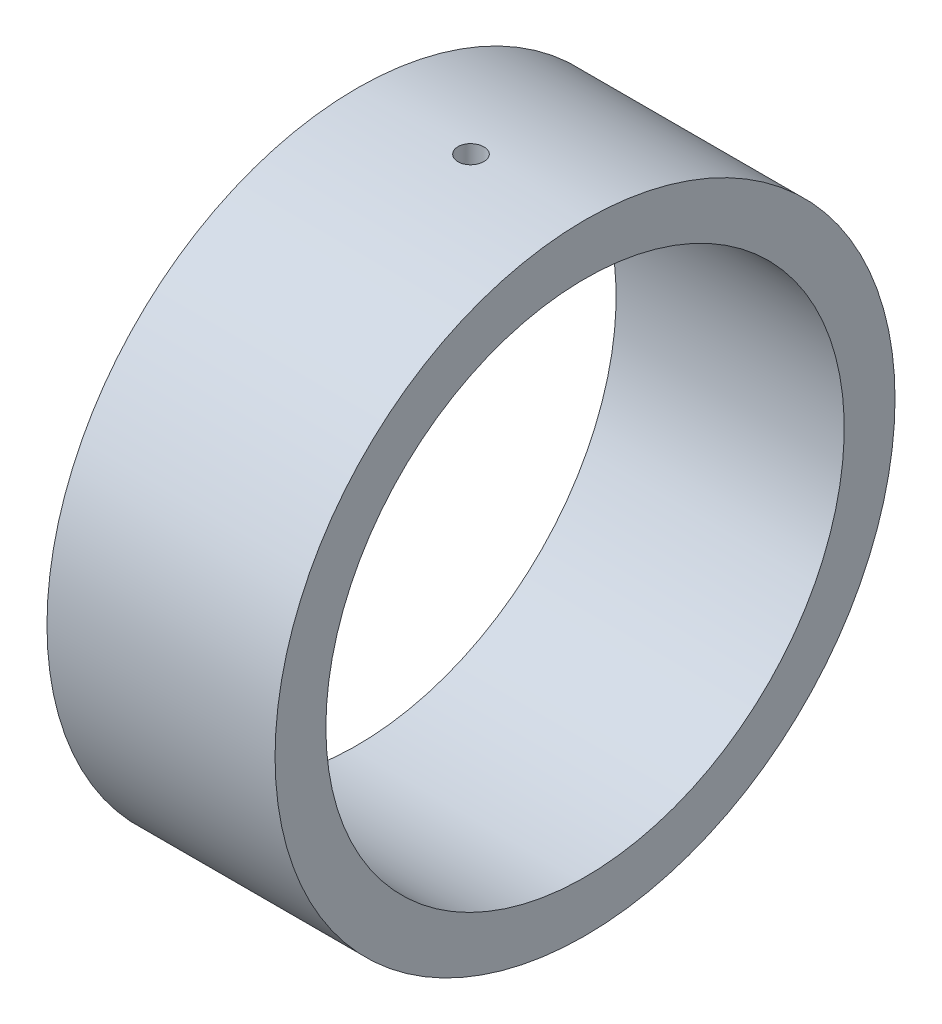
ISO-10303-21;
HEADER;
FILE_DESCRIPTION(('STEP AP214'),'2;1');
FILE_NAME('part.step','',(''),(''),'','','');
FILE_SCHEMA(('AUTOMOTIVE_DESIGN { 1 0 10303 214 1 1 1 1 }'));
ENDSEC;
DATA;
#1=APPLICATION_CONTEXT('core data for automotive mechanical design processes');
#2=APPLICATION_PROTOCOL_DEFINITION('international standard','automotive_design',2000,#1);
#3=PRODUCT_CONTEXT('',#1,'mechanical');
#4=PRODUCT('Part','Part','',(#3));
#5=PRODUCT_RELATED_PRODUCT_CATEGORY('part','',(#4));
#6=PRODUCT_DEFINITION_FORMATION('','',#4);
#7=PRODUCT_DEFINITION_CONTEXT('part definition',#1,'design');
#8=PRODUCT_DEFINITION('design','',#6,#7);
#9=PRODUCT_DEFINITION_SHAPE('','',#8);
#10=(LENGTH_UNIT() NAMED_UNIT(*) SI_UNIT(.MILLI.,.METRE.));
#11=(NAMED_UNIT(*) PLANE_ANGLE_UNIT() SI_UNIT($,.RADIAN.));
#12=(NAMED_UNIT(*) SI_UNIT($,.STERADIAN.) SOLID_ANGLE_UNIT());
#13=UNCERTAINTY_MEASURE_WITH_UNIT(LENGTH_MEASURE(1.E-05),#10,'distance_accuracy_value','');
#14=(GEOMETRIC_REPRESENTATION_CONTEXT(3) GLOBAL_UNCERTAINTY_ASSIGNED_CONTEXT((#13)) GLOBAL_UNIT_ASSIGNED_CONTEXT((#10,
#11,#12)) REPRESENTATION_CONTEXT('',''));
#15=CARTESIAN_POINT('',(0.,0.,0.));
#16=DIRECTION('',(0.,0.,1.));
#17=DIRECTION('',(1.,0.,0.));
#18=AXIS2_PLACEMENT_3D('',#15,#16,#17);
#19=CARTESIAN_POINT('',(27.,0.,0.));
#20=DIRECTION('',(-1.,0.,0.));
#21=DIRECTION('',(0.,0.,1.));
#22=AXIS2_PLACEMENT_3D('',#19,#20,#21);
#23=CYLINDRICAL_SURFACE('',#22,25.);
#24=CARTESIAN_POINT('',(27.,0.,0.));
#25=DIRECTION('',(-1.,0.,0.));
#26=DIRECTION('',(0.,0.,1.));
#27=AXIS2_PLACEMENT_3D('',#24,#25,#26);
#28=CIRCLE('',#27,25.);
#29=CARTESIAN_POINT('',(27.,0.,25.));
#30=VERTEX_POINT('',#29);
#31=EDGE_CURVE('E39',#30,#30,#28,.T.);
#32=ORIENTED_EDGE('',*,*,#31,.F.);
#33=EDGE_LOOP('',(#32));
#34=FACE_BOUND('',#33,.T.);
#35=CARTESIAN_POINT('',(5.,0.,0.));
#36=DIRECTION('',(-1.,0.,0.));
#37=DIRECTION('',(0.,0.,1.));
#38=AXIS2_PLACEMENT_3D('',#35,#36,#37);
#39=CIRCLE('',#38,25.);
#40=CARTESIAN_POINT('',(5.,0.,25.));
#41=VERTEX_POINT('',#40);
#42=EDGE_CURVE('E62',#41,#41,#39,.F.);
#43=ORIENTED_EDGE('',*,*,#42,.F.);
#44=EDGE_LOOP('',(#43));
#45=FACE_BOUND('',#44,.T.);
#46=CARTESIAN_POINT('',(14.75,25.,0.));
#47=CARTESIAN_POINT('',(14.7500029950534,24.9999995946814,0.0701708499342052));
#48=CARTESIAN_POINT('',(14.7559282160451,24.9997014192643,0.140387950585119));
#49=CARTESIAN_POINT('',(14.7794798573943,24.9985406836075,0.278881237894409));
#50=CARTESIAN_POINT('',(14.7971191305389,24.9976775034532,0.347155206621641));
#51=CARTESIAN_POINT('',(14.8435925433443,24.9954844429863,0.479741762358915));
#52=CARTESIAN_POINT('',(14.8724213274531,24.9941547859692,0.544056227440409));
#53=CARTESIAN_POINT('',(14.9404472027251,24.9911785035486,0.666916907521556));
#54=CARTESIAN_POINT('',(14.9796420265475,24.9895319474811,0.725464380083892));
#55=CARTESIAN_POINT('',(15.0673308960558,24.9861052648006,0.835203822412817));
#56=CARTESIAN_POINT('',(15.1158330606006,24.9843250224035,0.886389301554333));
#57=CARTESIAN_POINT('',(15.2207435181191,24.9808326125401,0.979896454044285));
#58=CARTESIAN_POINT('',(15.2771521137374,24.9791204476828,1.02221778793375));
#59=CARTESIAN_POINT('',(15.3963087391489,24.975956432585,1.09681356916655));
#60=CARTESIAN_POINT('',(15.4590599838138,24.9745047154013,1.12908288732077));
#61=CARTESIAN_POINT('',(15.5890979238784,24.9720267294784,1.18262570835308));
#62=CARTESIAN_POINT('',(15.6563845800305,24.9710004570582,1.20389930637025));
#63=CARTESIAN_POINT('',(15.7935231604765,24.9694901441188,1.23482956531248));
#64=CARTESIAN_POINT('',(15.8633728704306,24.9690056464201,1.24449602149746));
#65=CARTESIAN_POINT('',(16.003705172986,24.9686321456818,1.25196782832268));
#66=CARTESIAN_POINT('',(16.0741877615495,24.9687431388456,1.24977325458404));
#67=CARTESIAN_POINT('',(16.2137180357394,24.9695476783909,1.23359346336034));
#68=CARTESIAN_POINT('',(16.2827669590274,24.9702406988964,1.21961888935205));
#69=CARTESIAN_POINT('',(16.4175382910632,24.972130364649,1.18029205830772));
#70=CARTESIAN_POINT('',(16.4832606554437,24.9733270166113,1.15493964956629));
#71=CARTESIAN_POINT('',(16.6095490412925,24.9760897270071,1.09356362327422));
#72=CARTESIAN_POINT('',(16.670112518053,24.9776559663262,1.05753477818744));
#73=CARTESIAN_POINT('',(16.784330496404,24.9809809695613,0.975835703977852));
#74=CARTESIAN_POINT('',(16.8379855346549,24.9827397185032,0.930166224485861));
#75=CARTESIAN_POINT('',(16.9369216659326,24.9862536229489,0.830431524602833));
#76=CARTESIAN_POINT('',(16.982195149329,24.9880087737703,0.776358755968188));
#77=CARTESIAN_POINT('',(17.0630445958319,24.9913170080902,0.661345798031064));
#78=CARTESIAN_POINT('',(17.0986159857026,24.9928699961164,0.600402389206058));
#79=CARTESIAN_POINT('',(17.1590461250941,24.9955990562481,0.473358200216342));
#80=CARTESIAN_POINT('',(17.1838956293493,24.9967748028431,0.407253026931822));
#81=CARTESIAN_POINT('',(17.2220885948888,24.9986125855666,0.271893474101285));
#82=CARTESIAN_POINT('',(17.2354565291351,24.9992757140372,0.202646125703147));
#83=CARTESIAN_POINT('',(17.2452787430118,24.9997643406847,0.110795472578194));
#84=CARTESIAN_POINT('',(17.2470479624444,24.9998525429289,0.0886760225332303));
#85=CARTESIAN_POINT('',(17.2494090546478,24.9999704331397,0.0443742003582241));
#86=CARTESIAN_POINT('',(17.2500009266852,25.0000001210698,0.0221918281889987));
#87=CARTESIAN_POINT('',(17.2499970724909,24.9999996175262,-0.0701066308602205));
#88=CARTESIAN_POINT('',(17.2440779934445,24.9997017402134,-0.140307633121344));
#89=CARTESIAN_POINT('',(17.2205383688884,24.9985415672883,-0.278817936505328));
#90=CARTESIAN_POINT('',(17.2028928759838,24.9976780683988,-0.347122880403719));
#91=CARTESIAN_POINT('',(17.1564042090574,24.9954842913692,-0.479749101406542));
#92=CARTESIAN_POINT('',(17.1275706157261,24.9941544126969,-0.544073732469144));
#93=CARTESIAN_POINT('',(17.0595417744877,24.9911780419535,-0.666933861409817));
#94=CARTESIAN_POINT('',(17.0203516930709,24.9895317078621,-0.725472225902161));
#95=CARTESIAN_POINT('',(16.9326752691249,24.9861054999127,-0.835196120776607));
#96=CARTESIAN_POINT('',(16.8841807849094,24.9843255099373,-0.886375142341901));
#97=CARTESIAN_POINT('',(16.7792714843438,24.9808330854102,-0.979884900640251));
#98=CARTESIAN_POINT('',(16.7228541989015,24.9791206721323,-1.02221286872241));
#99=CARTESIAN_POINT('',(16.6036601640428,24.9759555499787,-1.09683400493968));
#100=CARTESIAN_POINT('',(16.5408775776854,24.9745030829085,-1.12911785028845));
#101=CARTESIAN_POINT('',(16.4108202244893,24.9720256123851,-1.18265015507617));
#102=CARTESIAN_POINT('',(16.3435505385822,24.9710001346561,-1.20391086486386));
#103=CARTESIAN_POINT('',(16.2299245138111,24.9697481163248,-1.22954319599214));
#104=CARTESIAN_POINT('',(16.1842847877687,24.9693682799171,-1.23720422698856));
#105=CARTESIAN_POINT('',(16.0924367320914,24.9688593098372,-1.24743361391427));
#106=CARTESIAN_POINT('',(16.0462284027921,24.9687301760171,-1.25000197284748));
#107=CARTESIAN_POINT('',(15.9298292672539,24.9687308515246,-1.24999700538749));
#108=CARTESIAN_POINT('',(15.8596122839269,24.9690294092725,-1.24407180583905));
#109=CARTESIAN_POINT('',(15.7211191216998,24.9701915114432,-1.22052022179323));
#110=CARTESIAN_POINT('',(15.6528451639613,24.9710556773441,-1.20288096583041));
#111=CARTESIAN_POINT('',(15.5202575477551,24.9732508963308,-1.1564072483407));
#112=CARTESIAN_POINT('',(15.455942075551,24.9745817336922,-1.12757795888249));
#113=CARTESIAN_POINT('',(15.3330817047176,24.9775599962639,-1.05955180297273));
#114=CARTESIAN_POINT('',(15.2745353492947,24.9792073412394,-1.02035756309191));
#115=CARTESIAN_POINT('',(15.1648030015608,24.982634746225,-0.932674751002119));
#116=CARTESIAN_POINT('',(15.1136228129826,24.9844149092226,-0.884178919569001));
#117=CARTESIAN_POINT('',(15.0201134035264,24.9879068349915,-0.779269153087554));
#118=CARTESIAN_POINT('',(14.9777865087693,24.9896185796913,-0.722853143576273));
#119=CARTESIAN_POINT('',(14.9031663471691,24.9927819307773,-0.603660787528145));
#120=CARTESIAN_POINT('',(14.8708825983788,24.9942332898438,-0.540878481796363));
#121=CARTESIAN_POINT('',(14.8173501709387,24.9967085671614,-0.410821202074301));
#122=CARTESIAN_POINT('',(14.796089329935,24.9977329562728,-0.343551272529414));
#123=CARTESIAN_POINT('',(14.7704568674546,24.9989835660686,-0.229924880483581));
#124=CARTESIAN_POINT('',(14.7627958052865,24.9993629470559,-0.184285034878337));
#125=CARTESIAN_POINT('',(14.752566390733,24.9998712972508,-0.0924368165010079));
#126=CARTESIAN_POINT('',(14.7499980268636,25.0000002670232,-0.0462284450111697));
#127=CARTESIAN_POINT('',(14.75,25.,0.));
#128=B_SPLINE_CURVE_WITH_KNOTS('',3,(#46,#47,#48,#49,#50,#51,#52,#53,#54,#55,#56,#57,#58,#59,
#60,#61,#62,#63,#64,#65,#66,#67,#68,#69,#70,#71,#72,#73,#74,#75,#76,#77,#78,#79,#80,#81,#82,#83,
#84,#85,#86,#87,#88,#89,#90,#91,#92,#93,#94,#95,#96,#97,#98,#99,#100,#101,#102,#103,#104,#105,
#106,#107,#108,#109,#110,#111,#112,#113,#114,#115,#116,#117,#118,#119,#120,#121,#122,#123,#124,
#125,#126,#127),.UNSPECIFIED.,.T.,.F.,(4,2,2,2,2,2,2,2,2,2,2,2,2,2,2,2,2,2,2,2,2,2,2,2,2,2,2,2,
2,2,2,2,2,2,2,2,2,2,2,2,4),(0.,0.210344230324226,0.420919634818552,0.631394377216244,
0.841823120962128,1.0524362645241,1.26305747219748,1.47378597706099,1.68451265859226,
1.89506138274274,2.10560876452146,2.31596611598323,2.52632627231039,2.73678959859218,
2.94723656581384,3.15787367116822,3.3686098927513,3.57952746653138,3.78999434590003,
3.85654306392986,3.92309182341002,4.13332728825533,4.34401145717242,4.55451560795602,
4.76491494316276,4.97549923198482,5.1861492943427,5.39699429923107,5.60760448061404,
5.7461788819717,5.88475320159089,6.09509708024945,6.30567246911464,6.51615064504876,
6.72657553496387,6.93716531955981,7.1478103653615,7.35865443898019,7.56926537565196,
7.70784013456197,7.84641458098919),.UNSPECIFIED.);
#129=CARTESIAN_POINT('',(14.75,25.,0.));
#130=VERTEX_POINT('',#129);
#131=EDGE_CURVE('E19',#130,#130,#128,.T.);
#132=ORIENTED_EDGE('',*,*,#131,.T.);
#133=EDGE_LOOP('',(#132));
#134=FACE_BOUND('',#133,.T.);
#135=ADVANCED_FACE('F14',(#34,#45,#134),#23,.F.);
#136=CARTESIAN_POINT('',(16.,0.,0.));
#137=DIRECTION('',(0.,1.,0.));
#138=DIRECTION('',(0.,0.,1.));
#139=AXIS2_PLACEMENT_3D('',#136,#137,#138);
#140=CYLINDRICAL_SURFACE('',#139,1.25);
#141=ORIENTED_EDGE('',*,*,#131,.F.);
#142=EDGE_LOOP('',(#141));
#143=FACE_BOUND('',#142,.T.);
#144=CARTESIAN_POINT('',(17.25,29.9,0.));
#145=CARTESIAN_POINT('',(17.2499970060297,29.8999996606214,0.0701853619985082));
#146=CARTESIAN_POINT('',(17.2440693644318,29.8997502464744,0.140417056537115));
#147=CARTESIAN_POINT('',(17.2205076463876,29.8987793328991,0.278939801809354));
#148=CARTESIAN_POINT('',(17.2028606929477,29.8980573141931,0.347228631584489));
#149=CARTESIAN_POINT('',(17.1563656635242,29.8962229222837,0.47984512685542));
#150=CARTESIAN_POINT('',(17.1275228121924,29.8951107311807,0.544174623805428));
#151=CARTESIAN_POINT('',(17.0594624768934,29.8926213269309,0.6670624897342));
#152=CARTESIAN_POINT('',(17.0202472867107,29.8912441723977,0.725622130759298));
#153=CARTESIAN_POINT('',(16.932522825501,29.8883787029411,0.835367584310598));
#154=CARTESIAN_POINT('',(16.8840076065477,29.8868903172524,0.886548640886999));
#155=CARTESIAN_POINT('',(16.7790718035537,29.8839707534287,0.980043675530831));
#156=CARTESIAN_POINT('',(16.7226509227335,29.8825395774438,1.0223573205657));
#157=CARTESIAN_POINT('',(16.6034819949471,29.8798953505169,1.09692828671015));
#158=CARTESIAN_POINT('',(16.5407317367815,29.8786823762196,1.1291820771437));
#159=CARTESIAN_POINT('',(16.4107009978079,29.8766121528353,1.18269502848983));
#160=CARTESIAN_POINT('',(16.3434205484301,29.8757549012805,1.2039542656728));
#161=CARTESIAN_POINT('',(16.2062812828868,29.8744934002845,1.23486263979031));
#162=CARTESIAN_POINT('',(16.136424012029,29.8740888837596,1.24451862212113));
#163=CARTESIAN_POINT('',(15.9960788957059,29.8737776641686,1.2519675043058));
#164=CARTESIAN_POINT('',(15.9255910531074,29.8738709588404,1.24976045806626));
#165=CARTESIAN_POINT('',(15.7860326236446,29.8745445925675,1.23355166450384));
#166=CARTESIAN_POINT('',(15.7169611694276,29.8751246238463,1.21955737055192));
#167=CARTESIAN_POINT('',(15.5821480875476,29.8767058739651,1.18018265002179));
#168=CARTESIAN_POINT('',(15.5164065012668,29.8777070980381,1.15480208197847));
#169=CARTESIAN_POINT('',(15.3900937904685,29.8800182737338,1.09336570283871));
#170=CARTESIAN_POINT('',(15.3295245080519,29.8813283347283,1.0573061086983));
#171=CARTESIAN_POINT('',(15.2153015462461,29.8841092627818,0.975541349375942));
#172=CARTESIAN_POINT('',(15.1616473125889,29.8855801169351,0.929836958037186));
#173=CARTESIAN_POINT('',(15.0627379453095,29.8885180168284,0.830047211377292));
#174=CARTESIAN_POINT('',(15.0174876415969,29.8899850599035,0.775957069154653));
#175=CARTESIAN_POINT('',(14.9366875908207,29.8927498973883,0.660914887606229));
#176=CARTESIAN_POINT('',(14.9011424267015,29.8940476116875,0.599959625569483));
#177=CARTESIAN_POINT('',(14.8407668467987,29.8963276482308,0.472899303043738));
#178=CARTESIAN_POINT('',(14.8159455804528,29.8973097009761,0.406789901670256));
#179=CARTESIAN_POINT('',(14.7778085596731,29.8988441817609,0.271429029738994));
#180=CARTESIAN_POINT('',(14.7644683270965,29.8993975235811,0.202184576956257));
#181=CARTESIAN_POINT('',(14.7546888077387,29.8998043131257,0.110414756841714));
#182=CARTESIAN_POINT('',(14.7529317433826,29.8998775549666,0.0883710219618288));
#183=CARTESIAN_POINT('',(14.7505868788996,29.8999754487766,0.0442213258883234));
#184=CARTESIAN_POINT('',(14.7499990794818,29.9000001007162,0.0221153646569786));
#185=CARTESIAN_POINT('',(14.7500029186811,29.8999996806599,-0.0701210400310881));
#186=CARTESIAN_POINT('',(14.7559244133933,29.8997505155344,-0.140336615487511));
#187=CARTESIAN_POINT('',(14.7794740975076,29.8987800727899,-0.278876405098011));
#188=CARTESIAN_POINT('',(14.7971272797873,29.8980577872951,-0.347196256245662));
#189=CARTESIAN_POINT('',(14.8436375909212,29.8962227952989,-0.479852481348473));
#190=CARTESIAN_POINT('',(14.8724852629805,29.8951104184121,-0.544192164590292));
#191=CARTESIAN_POINT('',(14.940548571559,29.8926209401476,-0.667079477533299));
#192=CARTESIAN_POINT('',(14.9797590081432,29.8912439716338,-0.725629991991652));
#193=CARTESIAN_POINT('',(15.0674709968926,29.888378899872,-0.835359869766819));
#194=CARTESIAN_POINT('',(15.1159785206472,29.8868907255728,-0.886534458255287));
#195=CARTESIAN_POINT('',(15.2209131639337,29.8839711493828,-0.980032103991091));
#196=CARTESIAN_POINT('',(15.2773427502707,29.8825397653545,-1.02235239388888));
#197=CARTESIAN_POINT('',(15.3965491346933,29.8798946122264,-1.0969487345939));
#198=CARTESIAN_POINT('',(15.4593307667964,29.8786810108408,-1.12921705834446));
#199=CARTESIAN_POINT('',(15.5893809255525,29.8766112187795,-1.18271948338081));
#200=CARTESIAN_POINT('',(15.6566443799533,29.8757546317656,-1.20396582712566));
#201=CARTESIAN_POINT('',(15.7702329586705,29.8747092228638,-1.22957145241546));
#202=CARTESIAN_POINT('',(15.8158421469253,29.8743921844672,-1.23722193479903));
#203=CARTESIAN_POINT('',(15.90762753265,29.8739673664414,-1.24743719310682));
#204=CARTESIAN_POINT('',(15.9538037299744,29.8738595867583,-1.25000197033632));
#205=CARTESIAN_POINT('',(16.0701852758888,29.8738601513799,-1.24999700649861));
#206=CARTESIAN_POINT('',(16.1404168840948,29.8741097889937,-1.24406938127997));
#207=CARTESIAN_POINT('',(16.2789395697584,29.8750815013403,-1.22050769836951));
#208=CARTESIAN_POINT('',(16.3472284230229,29.8758040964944,-1.20286074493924));
#209=CARTESIAN_POINT('',(16.4798460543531,29.8776397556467,-1.15636535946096));
#210=CARTESIAN_POINT('',(16.5441765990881,29.8787526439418,-1.12752196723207));
#211=CARTESIAN_POINT('',(16.667064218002,29.8812432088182,-1.05946127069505));
#212=CARTESIAN_POINT('',(16.7256227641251,29.8826208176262,-1.02024662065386));
#213=CARTESIAN_POINT('',(16.8353610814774,29.8854866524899,-0.932528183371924));
#214=CARTESIAN_POINT('',(16.8865367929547,29.8869749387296,-0.884019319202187));
#215=CARTESIAN_POINT('',(16.980033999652,29.8898942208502,-0.779084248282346));
#216=CARTESIAN_POINT('',(17.0223531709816,29.8913252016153,-0.722655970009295));
#217=CARTESIAN_POINT('',(17.0969484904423,29.8939693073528,-0.603451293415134));
#218=CARTESIAN_POINT('',(17.1292167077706,29.8951822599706,-0.540669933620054));
#219=CARTESIAN_POINT('',(17.1827192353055,29.89725077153,-0.410619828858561));
#220=CARTESIAN_POINT('',(17.2039656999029,29.8981067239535,-0.343356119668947));
#221=CARTESIAN_POINT('',(17.2295714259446,29.8991513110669,-0.229767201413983));
#222=CARTESIAN_POINT('',(17.2372219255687,29.8994680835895,-0.184157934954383));
#223=CARTESIAN_POINT('',(17.2474371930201,29.8998925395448,-0.0923724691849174));
#224=CARTESIAN_POINT('',(17.2500019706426,29.9000002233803,-0.0461962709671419));
#225=CARTESIAN_POINT('',(17.25,29.9,0.));
#226=B_SPLINE_CURVE_WITH_KNOTS('',3,(#144,#145,#146,#147,#148,#149,#150,#151,#152,#153,#154,
#155,#156,#157,#158,#159,#160,#161,#162,#163,#164,#165,#166,#167,#168,#169,#170,#171,#172,#173,
#174,#175,#176,#177,#178,#179,#180,#181,#182,#183,#184,#185,#186,#187,#188,#189,#190,#191,#192,
#193,#194,#195,#196,#197,#198,#199,#200,#201,#202,#203,#204,#205,#206,#207,#208,#209,#210,#211,
#212,#213,#214,#215,#216,#217,#218,#219,#220,#221,#222,#223,#224,#225),.UNSPECIFIED.,.T.,.F.,(4,
2,2,2,2,2,2,2,2,2,2,2,2,2,2,2,2,2,2,2,2,2,2,2,2,2,2,2,2,2,2,2,2,2,2,2,2,2,2,2,4),(0.,
0.210387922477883,0.421007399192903,0.631528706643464,0.8420034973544,1.05261335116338,
1.26323111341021,1.47392271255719,1.68461285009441,1.89517862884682,2.10574345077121,
2.316175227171,2.52660961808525,2.7371186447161,2.94761078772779,3.15822353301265,
3.36893556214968,3.57982701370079,3.79026771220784,3.85658723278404,3.92290679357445,
4.13318578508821,4.34391419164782,4.55446496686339,4.76491028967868,4.97549123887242,
5.18613790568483,5.39694610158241,5.60751964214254,5.74599780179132,5.884475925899,
6.09486359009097,6.30548314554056,6.51600800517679,6.72647903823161,6.93706536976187,
7.14770688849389,7.35851419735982,7.56908853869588,7.70756693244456,7.84604505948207),.UNSPECIFIED.);
#227=CARTESIAN_POINT('',(17.25,29.9,0.));
#228=VERTEX_POINT('',#227);
#229=EDGE_CURVE('E32',#228,#228,#226,.T.);
#230=ORIENTED_EDGE('',*,*,#229,.F.);
#231=EDGE_LOOP('',(#230));
#232=FACE_BOUND('',#231,.T.);
#233=ADVANCED_FACE('F40',(#143,#232),#140,.F.);
#234=CARTESIAN_POINT('',(5.,27.45,0.));
#235=DIRECTION('',(-1.,0.,0.));
#236=DIRECTION('',(0.,0.,1.));
#237=AXIS2_PLACEMENT_3D('',#234,#235,#236);
#238=PLANE('',#237);
#239=CARTESIAN_POINT('',(5.,0.,0.));
#240=DIRECTION('',(-1.,0.,0.));
#241=DIRECTION('',(0.,0.,1.));
#242=AXIS2_PLACEMENT_3D('',#239,#240,#241);
#243=CIRCLE('',#242,29.9);
#244=CARTESIAN_POINT('',(5.,0.,29.9));
#245=VERTEX_POINT('',#244);
#246=EDGE_CURVE('E27',#245,#245,#243,.F.);
#247=ORIENTED_EDGE('',*,*,#246,.F.);
#248=EDGE_LOOP('',(#247));
#249=FACE_BOUND('',#248,.T.);
#250=ORIENTED_EDGE('',*,*,#42,.T.);
#251=EDGE_LOOP('',(#250));
#252=FACE_BOUND('',#251,.T.);
#253=ADVANCED_FACE('F44',(#249,#252),#238,.T.);
#254=CARTESIAN_POINT('',(27.,27.45,0.));
#255=DIRECTION('',(1.,0.,0.));
#256=DIRECTION('',(0.,0.,-1.));
#257=AXIS2_PLACEMENT_3D('',#254,#255,#256);
#258=PLANE('',#257);
#259=ORIENTED_EDGE('',*,*,#31,.T.);
#260=EDGE_LOOP('',(#259));
#261=FACE_BOUND('',#260,.T.);
#262=CARTESIAN_POINT('',(27.,0.,0.));
#263=DIRECTION('',(-1.,0.,0.));
#264=DIRECTION('',(0.,0.,1.));
#265=AXIS2_PLACEMENT_3D('',#262,#263,#264);
#266=CIRCLE('',#265,29.9);
#267=CARTESIAN_POINT('',(27.,0.,29.9));
#268=VERTEX_POINT('',#267);
#269=EDGE_CURVE('E10',#268,#268,#266,.T.);
#270=ORIENTED_EDGE('',*,*,#269,.F.);
#271=EDGE_LOOP('',(#270));
#272=FACE_BOUND('',#271,.T.);
#273=ADVANCED_FACE('F49',(#261,#272),#258,.T.);
#274=CARTESIAN_POINT('',(16.,0.,0.));
#275=DIRECTION('',(-1.,0.,0.));
#276=DIRECTION('',(0.,0.,1.));
#277=AXIS2_PLACEMENT_3D('',#274,#275,#276);
#278=CYLINDRICAL_SURFACE('',#277,29.9);
#279=ORIENTED_EDGE('',*,*,#229,.T.);
#280=EDGE_LOOP('',(#279));
#281=FACE_BOUND('',#280,.T.);
#282=ORIENTED_EDGE('',*,*,#246,.T.);
#283=EDGE_LOOP('',(#282));
#284=FACE_BOUND('',#283,.T.);
#285=ORIENTED_EDGE('',*,*,#269,.T.);
#286=EDGE_LOOP('',(#285));
#287=FACE_BOUND('',#286,.T.);
#288=ADVANCED_FACE('F16',(#281,#284,#287),#278,.T.);
#289=CLOSED_SHELL('',(#135,#233,#253,#273,#288));
#290=MANIFOLD_SOLID_BREP('B1',#289);
#291=ADVANCED_BREP_SHAPE_REPRESENTATION('',(#18,#290),#14);
#292=SHAPE_DEFINITION_REPRESENTATION(#9,#291);
ENDSEC;
END-ISO-10303-21;
